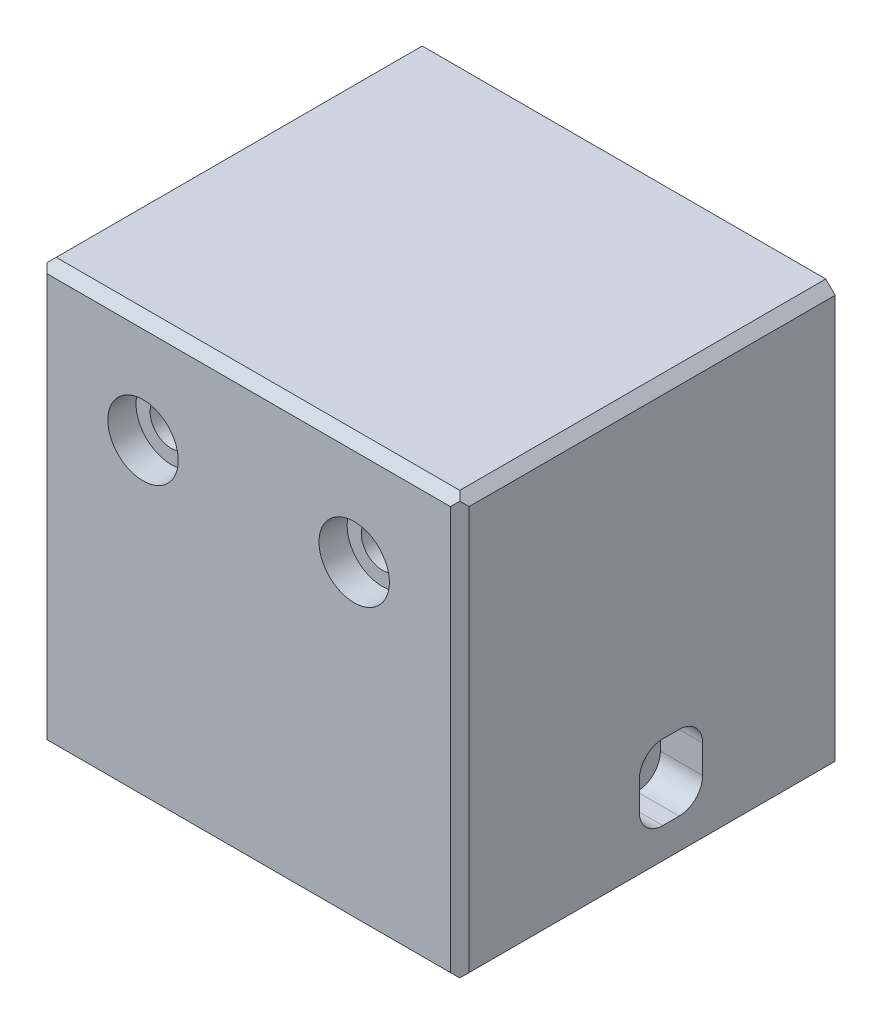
ISO-10303-21;
HEADER;
FILE_DESCRIPTION(('STEP AP214'),'2;1');
FILE_NAME('part.step','',(''),(''),'','','');
FILE_SCHEMA(('AUTOMOTIVE_DESIGN { 1 0 10303 214 1 1 1 1 }'));
ENDSEC;
DATA;
#1=APPLICATION_CONTEXT('core data for automotive mechanical design processes');
#2=APPLICATION_PROTOCOL_DEFINITION('international standard','automotive_design',2000,#1);
#3=PRODUCT_CONTEXT('',#1,'mechanical');
#4=PRODUCT('Part','Part','',(#3));
#5=PRODUCT_RELATED_PRODUCT_CATEGORY('part','',(#4));
#6=PRODUCT_DEFINITION_FORMATION('','',#4);
#7=PRODUCT_DEFINITION_CONTEXT('part definition',#1,'design');
#8=PRODUCT_DEFINITION('design','',#6,#7);
#9=PRODUCT_DEFINITION_SHAPE('','',#8);
#10=(LENGTH_UNIT() NAMED_UNIT(*) SI_UNIT(.MILLI.,.METRE.));
#11=(NAMED_UNIT(*) PLANE_ANGLE_UNIT() SI_UNIT($,.RADIAN.));
#12=(NAMED_UNIT(*) SI_UNIT($,.STERADIAN.) SOLID_ANGLE_UNIT());
#13=UNCERTAINTY_MEASURE_WITH_UNIT(LENGTH_MEASURE(1.E-05),#10,'distance_accuracy_value','');
#14=(GEOMETRIC_REPRESENTATION_CONTEXT(3) GLOBAL_UNCERTAINTY_ASSIGNED_CONTEXT((#13)) GLOBAL_UNIT_ASSIGNED_CONTEXT((#10,
#11,#12)) REPRESENTATION_CONTEXT('',''));
#15=CARTESIAN_POINT('',(0.,0.,0.));
#16=DIRECTION('',(0.,0.,1.));
#17=DIRECTION('',(1.,0.,0.));
#18=AXIS2_PLACEMENT_3D('',#15,#16,#17);
#19=CARTESIAN_POINT('',(-22.4999999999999,-22.5000000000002,74.));
#20=DIRECTION('',(0.,0.,1.));
#21=DIRECTION('',(1.,0.,0.));
#22=AXIS2_PLACEMENT_3D('',#19,#20,#21);
#23=CYLINDRICAL_SURFACE('',#22,7.5);
#24=CARTESIAN_POINT('',(-22.4999999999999,-22.5000000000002,80.));
#25=DIRECTION('',(0.,0.,1.));
#26=DIRECTION('',(1.,0.,0.));
#27=AXIS2_PLACEMENT_3D('',#24,#25,#26);
#28=CIRCLE('',#27,7.5);
#29=CARTESIAN_POINT('',(-14.9999999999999,-22.5000000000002,80.));
#30=VERTEX_POINT('',#29);
#31=EDGE_CURVE('E9',#30,#30,#28,.T.);
#32=ORIENTED_EDGE('',*,*,#31,.T.);
#33=EDGE_LOOP('',(#32));
#34=FACE_BOUND('',#33,.T.);
#35=CARTESIAN_POINT('',(-22.4999999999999,-22.5000000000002,74.));
#36=DIRECTION('',(0.,0.,1.));
#37=DIRECTION('',(1.,0.,0.));
#38=AXIS2_PLACEMENT_3D('',#35,#36,#37);
#39=CIRCLE('',#38,7.5);
#40=CARTESIAN_POINT('',(-14.9999999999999,-22.5000000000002,74.));
#41=VERTEX_POINT('',#40);
#42=EDGE_CURVE('E270',#41,#41,#39,.T.);
#43=ORIENTED_EDGE('',*,*,#42,.F.);
#44=EDGE_LOOP('',(#43));
#45=FACE_BOUND('',#44,.T.);
#46=ADVANCED_FACE('F15',(#34,#45),#23,.F.);
#47=CARTESIAN_POINT('',(-22.4999999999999,-22.5000000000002,15.));
#48=DIRECTION('',(0.,0.,1.));
#49=DIRECTION('',(1.,0.,0.));
#50=AXIS2_PLACEMENT_3D('',#47,#48,#49);
#51=CYLINDRICAL_SURFACE('',#50,4.5);
#52=CARTESIAN_POINT('',(-22.4999999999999,-22.5000000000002,74.));
#53=DIRECTION('',(0.,0.,1.));
#54=DIRECTION('',(1.,0.,0.));
#55=AXIS2_PLACEMENT_3D('',#52,#53,#54);
#56=CIRCLE('',#55,4.5);
#57=CARTESIAN_POINT('',(-17.9999999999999,-22.5000000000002,74.));
#58=VERTEX_POINT('',#57);
#59=EDGE_CURVE('E25',#58,#58,#56,.T.);
#60=ORIENTED_EDGE('',*,*,#59,.T.);
#61=EDGE_LOOP('',(#60));
#62=FACE_BOUND('',#61,.T.);
#63=CARTESIAN_POINT('',(-22.4999999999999,-22.5000000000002,0.));
#64=DIRECTION('',(0.,0.,1.));
#65=DIRECTION('',(1.,0.,0.));
#66=AXIS2_PLACEMENT_3D('',#63,#64,#65);
#67=CIRCLE('',#66,4.5);
#68=CARTESIAN_POINT('',(-17.9999999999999,-22.5000000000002,0.));
#69=VERTEX_POINT('',#68);
#70=EDGE_CURVE('E306',#69,#69,#67,.T.);
#71=ORIENTED_EDGE('',*,*,#70,.F.);
#72=EDGE_LOOP('',(#71));
#73=FACE_BOUND('',#72,.T.);
#74=ADVANCED_FACE('F530',(#62,#73),#51,.F.);
#75=CARTESIAN_POINT('',(22.5000000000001,-22.5000000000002,77.));
#76=DIRECTION('',(0.,0.,-1.));
#77=DIRECTION('',(0.,-1.,0.));
#78=AXIS2_PLACEMENT_3D('',#75,#76,#77);
#79=CYLINDRICAL_SURFACE('',#78,7.5);
#80=CARTESIAN_POINT('',(22.5000000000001,-22.5000000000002,80.));
#81=DIRECTION('',(0.,0.,-1.));
#82=DIRECTION('',(0.,-1.,0.));
#83=AXIS2_PLACEMENT_3D('',#80,#81,#82);
#84=CIRCLE('',#83,7.5);
#85=CARTESIAN_POINT('',(22.5000000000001,-30.0000000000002,80.));
#86=VERTEX_POINT('',#85);
#87=EDGE_CURVE('E275',#86,#86,#84,.T.);
#88=ORIENTED_EDGE('',*,*,#87,.F.);
#89=EDGE_LOOP('',(#88));
#90=FACE_BOUND('',#89,.T.);
#91=CARTESIAN_POINT('',(22.5000000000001,-22.5000000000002,74.));
#92=DIRECTION('',(0.,0.,-1.));
#93=DIRECTION('',(0.,-1.,0.));
#94=AXIS2_PLACEMENT_3D('',#91,#92,#93);
#95=CIRCLE('',#94,7.5);
#96=CARTESIAN_POINT('',(22.5000000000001,-30.0000000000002,74.));
#97=VERTEX_POINT('',#96);
#98=EDGE_CURVE('E511',#97,#97,#95,.T.);
#99=ORIENTED_EDGE('',*,*,#98,.T.);
#100=EDGE_LOOP('',(#99));
#101=FACE_BOUND('',#100,.T.);
#102=ADVANCED_FACE('F537',(#90,#101),#79,.F.);
#103=CARTESIAN_POINT('',(22.5000000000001,-22.5000000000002,37.));
#104=DIRECTION('',(0.,0.,-1.));
#105=DIRECTION('',(0.,-1.,0.));
#106=AXIS2_PLACEMENT_3D('',#103,#104,#105);
#107=CYLINDRICAL_SURFACE('',#106,4.50000000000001);
#108=CARTESIAN_POINT('',(22.5000000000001,-22.5000000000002,74.));
#109=DIRECTION('',(0.,0.,-1.));
#110=DIRECTION('',(0.,-1.,0.));
#111=AXIS2_PLACEMENT_3D('',#108,#109,#110);
#112=CIRCLE('',#111,4.5);
#113=CARTESIAN_POINT('',(22.5000000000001,-27.0000000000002,74.));
#114=VERTEX_POINT('',#113);
#115=EDGE_CURVE('E302',#114,#114,#112,.T.);
#116=ORIENTED_EDGE('',*,*,#115,.F.);
#117=EDGE_LOOP('',(#116));
#118=FACE_BOUND('',#117,.T.);
#119=CARTESIAN_POINT('',(22.5000000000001,-22.5000000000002,0.));
#120=DIRECTION('',(0.,0.,-1.));
#121=DIRECTION('',(0.,-1.,0.));
#122=AXIS2_PLACEMENT_3D('',#119,#120,#121);
#123=CIRCLE('',#122,4.5);
#124=CARTESIAN_POINT('',(22.5000000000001,-27.0000000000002,0.));
#125=VERTEX_POINT('',#124);
#126=EDGE_CURVE('E506',#125,#125,#123,.T.);
#127=ORIENTED_EDGE('',*,*,#126,.T.);
#128=EDGE_LOOP('',(#127));
#129=FACE_BOUND('',#128,.T.);
#130=ADVANCED_FACE('F687',(#118,#129),#107,.F.);
#131=CARTESIAN_POINT('',(-24.2500000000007,-73.5000146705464,35.));
#132=DIRECTION('',(-1.,0.,0.));
#133=DIRECTION('',(0.,0.,1.));
#134=AXIS2_PLACEMENT_3D('',#131,#132,#133);
#135=CYLINDRICAL_SURFACE('',#134,4.50000000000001);
#136=CARTESIAN_POINT('',(-12.5000000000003,-73.5000146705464,35.));
#137=DIRECTION('',(-1.,0.,0.));
#138=DIRECTION('',(0.,0.,1.));
#139=AXIS2_PLACEMENT_3D('',#136,#137,#138);
#140=CIRCLE('',#139,4.5);
#141=CARTESIAN_POINT('',(-12.5000000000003,-73.5000146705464,39.5));
#142=VERTEX_POINT('',#141);
#143=EDGE_CURVE('E342',#142,#142,#140,.T.);
#144=ORIENTED_EDGE('',*,*,#143,.F.);
#145=EDGE_LOOP('',(#144));
#146=FACE_BOUND('',#145,.T.);
#147=CARTESIAN_POINT('',(-36.000000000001,-73.5000146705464,35.));
#148=DIRECTION('',(-1.,0.,0.));
#149=DIRECTION('',(0.,0.,1.));
#150=AXIS2_PLACEMENT_3D('',#147,#148,#149);
#151=CIRCLE('',#150,4.5);
#152=CARTESIAN_POINT('',(-36.000000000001,-73.5000146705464,39.5));
#153=VERTEX_POINT('',#152);
#154=EDGE_CURVE('E503',#153,#153,#151,.T.);
#155=ORIENTED_EDGE('',*,*,#154,.T.);
#156=EDGE_LOOP('',(#155));
#157=FACE_BOUND('',#156,.T.);
#158=ADVANCED_FACE('F690',(#146,#157),#135,.F.);
#159=CARTESIAN_POINT('',(24.2500000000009,-73.5000146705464,35.));
#160=DIRECTION('',(-1.,0.,0.));
#161=DIRECTION('',(0.,1.,0.));
#162=AXIS2_PLACEMENT_3D('',#159,#160,#161);
#163=CYLINDRICAL_SURFACE('',#162,4.50000000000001);
#164=CARTESIAN_POINT('',(36.0000000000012,-73.5000146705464,35.));
#165=DIRECTION('',(1.,0.,0.));
#166=DIRECTION('',(0.,1.,0.));
#167=AXIS2_PLACEMENT_3D('',#164,#165,#166);
#168=CIRCLE('',#167,4.5);
#169=CARTESIAN_POINT('',(36.0000000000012,-69.0000146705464,35.));
#170=VERTEX_POINT('',#169);
#171=EDGE_CURVE('E496',#170,#170,#168,.T.);
#172=ORIENTED_EDGE('',*,*,#171,.T.);
#173=EDGE_LOOP('',(#172));
#174=FACE_BOUND('',#173,.T.);
#175=CARTESIAN_POINT('',(12.5000000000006,-73.5000146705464,35.));
#176=DIRECTION('',(1.,0.,0.));
#177=DIRECTION('',(0.,1.,0.));
#178=AXIS2_PLACEMENT_3D('',#175,#176,#177);
#179=CIRCLE('',#178,4.5);
#180=CARTESIAN_POINT('',(12.5000000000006,-69.0000146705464,35.));
#181=VERTEX_POINT('',#180);
#182=EDGE_CURVE('E498',#181,#181,#179,.T.);
#183=ORIENTED_EDGE('',*,*,#182,.F.);
#184=EDGE_LOOP('',(#183));
#185=FACE_BOUND('',#184,.T.);
#186=ADVANCED_FACE('F696',(#174,#185),#163,.F.);
#187=CARTESIAN_POINT('',(-44.9999999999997,-70.5000146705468,33.25));
#188=DIRECTION('',(1.,0.,0.));
#189=DIRECTION('',(0.,1.,0.));
#190=AXIS2_PLACEMENT_3D('',#187,#188,#189);
#191=CYLINDRICAL_SURFACE('',#190,5.);
#192=CARTESIAN_POINT('',(-36.000000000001,-70.5000146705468,33.25));
#193=DIRECTION('',(-1.,0.,0.));
#194=DIRECTION('',(0.,0.,1.));
#195=AXIS2_PLACEMENT_3D('',#192,#193,#194);
#196=CIRCLE('',#195,5.);
#197=CARTESIAN_POINT('',(-36.0000000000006,-65.5000146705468,33.25));
#198=VERTEX_POINT('',#197);
#199=CARTESIAN_POINT('',(-36.000000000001,-70.5000146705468,28.25));
#200=VERTEX_POINT('',#199);
#201=EDGE_CURVE('E34',#198,#200,#196,.T.);
#202=ORIENTED_EDGE('',*,*,#201,.F.);
#203=DIRECTION('',(1.,0.,0.));
#204=VECTOR('',#203,1.);
#205=CARTESIAN_POINT('',(-44.9999999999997,-65.5000146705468,33.25));
#206=LINE('',#205,#204);
#207=CARTESIAN_POINT('',(-44.9999999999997,-65.5000146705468,33.25));
#208=VERTEX_POINT('',#207);
#209=EDGE_CURVE('E491',#208,#198,#206,.T.);
#210=ORIENTED_EDGE('',*,*,#209,.F.);
#211=CARTESIAN_POINT('',(-44.9999999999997,-70.5000146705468,33.25));
#212=DIRECTION('',(1.,0.,0.));
#213=DIRECTION('',(0.,1.,0.));
#214=AXIS2_PLACEMENT_3D('',#211,#212,#213);
#215=CIRCLE('',#214,5.);
#216=CARTESIAN_POINT('',(-44.9999999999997,-70.5000146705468,28.25));
#217=VERTEX_POINT('',#216);
#218=EDGE_CURVE('E441',#217,#208,#215,.T.);
#219=ORIENTED_EDGE('',*,*,#218,.F.);
#220=DIRECTION('',(-1.,0.,0.));
#221=VECTOR('',#220,1.);
#222=CARTESIAN_POINT('',(-36.000000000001,-70.5000146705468,28.25));
#223=LINE('',#222,#221);
#224=EDGE_CURVE('E458',#200,#217,#223,.T.);
#225=ORIENTED_EDGE('',*,*,#224,.F.);
#226=EDGE_LOOP('',(#202,#210,#219,#225));
#227=FACE_BOUND('',#226,.T.);
#228=ADVANCED_FACE('F542',(#227),#191,.F.);
#229=CARTESIAN_POINT('',(-36.0000000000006,-65.5000146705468,35.));
#230=DIRECTION('',(0.,1.,0.));
#231=DIRECTION('',(0.,0.,1.));
#232=AXIS2_PLACEMENT_3D('',#229,#230,#231);
#233=PLANE('',#232);
#234=ORIENTED_EDGE('',*,*,#209,.T.);
#235=DIRECTION('',(0.,0.,1.));
#236=VECTOR('',#235,1.);
#237=CARTESIAN_POINT('',(-36.0000000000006,-65.5000146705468,33.25));
#238=LINE('',#237,#236);
#239=CARTESIAN_POINT('',(-36.0000000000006,-65.5000146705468,36.75));
#240=VERTEX_POINT('',#239);
#241=EDGE_CURVE('E488',#198,#240,#238,.T.);
#242=ORIENTED_EDGE('',*,*,#241,.T.);
#243=DIRECTION('',(-1.,0.,0.));
#244=VECTOR('',#243,1.);
#245=CARTESIAN_POINT('',(-36.0000000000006,-65.5000146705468,36.75));
#246=LINE('',#245,#244);
#247=CARTESIAN_POINT('',(-44.9999999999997,-65.5000146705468,36.75));
#248=VERTEX_POINT('',#247);
#249=EDGE_CURVE('E482',#240,#248,#246,.T.);
#250=ORIENTED_EDGE('',*,*,#249,.T.);
#251=DIRECTION('',(0.,0.,1.));
#252=VECTOR('',#251,1.);
#253=CARTESIAN_POINT('',(-44.9999999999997,-65.5000146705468,33.25));
#254=LINE('',#253,#252);
#255=EDGE_CURVE('E479',#208,#248,#254,.T.);
#256=ORIENTED_EDGE('',*,*,#255,.F.);
#257=EDGE_LOOP('',(#234,#242,#250,#256));
#258=FACE_BOUND('',#257,.T.);
#259=ADVANCED_FACE('F548',(#258),#233,.F.);
#260=CARTESIAN_POINT('',(-44.9999999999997,-70.5000146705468,36.75));
#261=DIRECTION('',(1.,0.,0.));
#262=DIRECTION('',(0.,1.,0.));
#263=AXIS2_PLACEMENT_3D('',#260,#261,#262);
#264=CYLINDRICAL_SURFACE('',#263,5.);
#265=CARTESIAN_POINT('',(-36.000000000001,-70.5000146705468,36.75));
#266=DIRECTION('',(-1.,0.,0.));
#267=DIRECTION('',(0.,0.,1.));
#268=AXIS2_PLACEMENT_3D('',#265,#266,#267);
#269=CIRCLE('',#268,5.);
#270=CARTESIAN_POINT('',(-36.0000000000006,-70.5000146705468,41.75));
#271=VERTEX_POINT('',#270);
#272=EDGE_CURVE('E475',#271,#240,#269,.T.);
#273=ORIENTED_EDGE('',*,*,#272,.F.);
#274=DIRECTION('',(1.,0.,0.));
#275=VECTOR('',#274,1.);
#276=CARTESIAN_POINT('',(-44.9999999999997,-70.5000146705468,41.75));
#277=LINE('',#276,#275);
#278=CARTESIAN_POINT('',(-44.9999999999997,-70.5000146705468,41.75));
#279=VERTEX_POINT('',#278);
#280=EDGE_CURVE('E472',#279,#271,#277,.T.);
#281=ORIENTED_EDGE('',*,*,#280,.F.);
#282=CARTESIAN_POINT('',(-44.9999999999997,-70.5000146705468,36.75));
#283=DIRECTION('',(1.,0.,0.));
#284=DIRECTION('',(0.,1.,0.));
#285=AXIS2_PLACEMENT_3D('',#282,#283,#284);
#286=CIRCLE('',#285,5.);
#287=EDGE_CURVE('E477',#248,#279,#286,.T.);
#288=ORIENTED_EDGE('',*,*,#287,.F.);
#289=ORIENTED_EDGE('',*,*,#249,.F.);
#290=EDGE_LOOP('',(#273,#281,#288,#289));
#291=FACE_BOUND('',#290,.T.);
#292=ADVANCED_FACE('F544',(#291),#264,.F.);
#293=CARTESIAN_POINT('',(-44.9999999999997,-75.0000146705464,41.75));
#294=DIRECTION('',(0.,0.,1.));
#295=DIRECTION('',(1.,0.,0.));
#296=AXIS2_PLACEMENT_3D('',#293,#294,#295);
#297=PLANE('',#296);
#298=DIRECTION('',(0.,-1.,0.));
#299=VECTOR('',#298,1.);
#300=CARTESIAN_POINT('',(-44.9999999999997,-70.5000146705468,41.75));
#301=LINE('',#300,#299);
#302=CARTESIAN_POINT('',(-44.9999999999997,-76.5000146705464,41.75));
#303=VERTEX_POINT('',#302);
#304=EDGE_CURVE('E449',#279,#303,#301,.T.);
#305=ORIENTED_EDGE('',*,*,#304,.F.);
#306=ORIENTED_EDGE('',*,*,#280,.T.);
#307=DIRECTION('',(0.,1.,0.));
#308=VECTOR('',#307,1.);
#309=CARTESIAN_POINT('',(-36.0000000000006,-76.5000146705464,41.75));
#310=LINE('',#309,#308);
#311=CARTESIAN_POINT('',(-36.0000000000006,-76.5000146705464,41.75));
#312=VERTEX_POINT('',#311);
#313=EDGE_CURVE('E468',#312,#271,#310,.T.);
#314=ORIENTED_EDGE('',*,*,#313,.F.);
#315=DIRECTION('',(-1.,0.,0.));
#316=VECTOR('',#315,1.);
#317=CARTESIAN_POINT('',(-36.0000000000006,-76.5000146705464,41.75));
#318=LINE('',#317,#316);
#319=EDGE_CURVE('E463',#312,#303,#318,.T.);
#320=ORIENTED_EDGE('',*,*,#319,.T.);
#321=EDGE_LOOP('',(#305,#306,#314,#320));
#322=FACE_BOUND('',#321,.T.);
#323=ADVANCED_FACE('F547',(#322),#297,.F.);
#324=CARTESIAN_POINT('',(-44.9999999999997,-76.5000146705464,33.25));
#325=DIRECTION('',(1.,0.,0.));
#326=DIRECTION('',(0.,1.,0.));
#327=AXIS2_PLACEMENT_3D('',#324,#325,#326);
#328=CYLINDRICAL_SURFACE('',#327,5.);
#329=CARTESIAN_POINT('',(-36.000000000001,-76.5000146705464,33.25));
#330=DIRECTION('',(-1.,0.,0.));
#331=DIRECTION('',(0.,0.,1.));
#332=AXIS2_PLACEMENT_3D('',#329,#330,#331);
#333=CIRCLE('',#332,5.);
#334=CARTESIAN_POINT('',(-36.000000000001,-76.5000146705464,28.25));
#335=VERTEX_POINT('',#334);
#336=CARTESIAN_POINT('',(-36.0000000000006,-81.5000146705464,33.25));
#337=VERTEX_POINT('',#336);
#338=EDGE_CURVE('E445',#335,#337,#333,.T.);
#339=ORIENTED_EDGE('',*,*,#338,.F.);
#340=DIRECTION('',(1.,0.,0.));
#341=VECTOR('',#340,1.);
#342=CARTESIAN_POINT('',(-44.9999999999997,-76.5000146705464,28.25));
#343=LINE('',#342,#341);
#344=CARTESIAN_POINT('',(-44.9999999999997,-76.5000146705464,28.25));
#345=VERTEX_POINT('',#344);
#346=EDGE_CURVE('E465',#345,#335,#343,.T.);
#347=ORIENTED_EDGE('',*,*,#346,.F.);
#348=CARTESIAN_POINT('',(-44.9999999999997,-76.5000146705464,33.25));
#349=DIRECTION('',(1.,0.,0.));
#350=DIRECTION('',(0.,1.,0.));
#351=AXIS2_PLACEMENT_3D('',#348,#349,#350);
#352=CIRCLE('',#351,5.);
#353=CARTESIAN_POINT('',(-44.9999999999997,-81.5000146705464,33.25));
#354=VERTEX_POINT('',#353);
#355=EDGE_CURVE('E361',#354,#345,#352,.T.);
#356=ORIENTED_EDGE('',*,*,#355,.F.);
#357=DIRECTION('',(-1.,0.,0.));
#358=VECTOR('',#357,1.);
#359=CARTESIAN_POINT('',(-36.0000000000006,-81.5000146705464,33.25));
#360=LINE('',#359,#358);
#361=EDGE_CURVE('E457',#337,#354,#360,.T.);
#362=ORIENTED_EDGE('',*,*,#361,.F.);
#363=EDGE_LOOP('',(#339,#347,#356,#362));
#364=FACE_BOUND('',#363,.T.);
#365=ADVANCED_FACE('F550',(#364),#328,.F.);
#366=CARTESIAN_POINT('',(-44.9999999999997,-81.5000146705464,28.25));
#367=DIRECTION('',(0.,-1.,0.));
#368=DIRECTION('',(0.,0.,-1.));
#369=AXIS2_PLACEMENT_3D('',#366,#367,#368);
#370=PLANE('',#369);
#371=ORIENTED_EDGE('',*,*,#361,.T.);
#372=DIRECTION('',(0.,0.,-1.));
#373=VECTOR('',#372,1.);
#374=CARTESIAN_POINT('',(-44.9999999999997,-81.5000146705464,36.75));
#375=LINE('',#374,#373);
#376=CARTESIAN_POINT('',(-44.9999999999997,-81.5000146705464,36.75));
#377=VERTEX_POINT('',#376);
#378=EDGE_CURVE('E355',#377,#354,#375,.T.);
#379=ORIENTED_EDGE('',*,*,#378,.F.);
#380=DIRECTION('',(1.,0.,0.));
#381=VECTOR('',#380,1.);
#382=CARTESIAN_POINT('',(-44.9999999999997,-81.5000146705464,36.75));
#383=LINE('',#382,#381);
#384=CARTESIAN_POINT('',(-36.0000000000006,-81.5000146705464,36.75));
#385=VERTEX_POINT('',#384);
#386=EDGE_CURVE('E454',#377,#385,#383,.T.);
#387=ORIENTED_EDGE('',*,*,#386,.T.);
#388=DIRECTION('',(0.,0.,1.));
#389=VECTOR('',#388,1.);
#390=CARTESIAN_POINT('',(-36.0000000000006,-81.5000146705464,33.25));
#391=LINE('',#390,#389);
#392=EDGE_CURVE('E452',#337,#385,#391,.T.);
#393=ORIENTED_EDGE('',*,*,#392,.F.);
#394=EDGE_LOOP('',(#371,#379,#387,#393));
#395=FACE_BOUND('',#394,.T.);
#396=ADVANCED_FACE('F553',(#395),#370,.F.);
#397=CARTESIAN_POINT('',(-44.9999999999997,-76.5000146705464,36.75));
#398=DIRECTION('',(1.,0.,0.));
#399=DIRECTION('',(0.,1.,0.));
#400=AXIS2_PLACEMENT_3D('',#397,#398,#399);
#401=CYLINDRICAL_SURFACE('',#400,5.);
#402=CARTESIAN_POINT('',(-36.000000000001,-76.5000146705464,36.75));
#403=DIRECTION('',(-1.,0.,0.));
#404=DIRECTION('',(0.,0.,1.));
#405=AXIS2_PLACEMENT_3D('',#402,#403,#404);
#406=CIRCLE('',#405,5.);
#407=EDGE_CURVE('E437',#385,#312,#406,.T.);
#408=ORIENTED_EDGE('',*,*,#407,.F.);
#409=ORIENTED_EDGE('',*,*,#386,.F.);
#410=CARTESIAN_POINT('',(-44.9999999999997,-76.5000146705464,36.75));
#411=DIRECTION('',(1.,0.,0.));
#412=DIRECTION('',(0.,1.,0.));
#413=AXIS2_PLACEMENT_3D('',#410,#411,#412);
#414=CIRCLE('',#413,5.);
#415=EDGE_CURVE('E446',#303,#377,#414,.T.);
#416=ORIENTED_EDGE('',*,*,#415,.F.);
#417=ORIENTED_EDGE('',*,*,#319,.F.);
#418=EDGE_LOOP('',(#408,#409,#416,#417));
#419=FACE_BOUND('',#418,.T.);
#420=ADVANCED_FACE('F555',(#419),#401,.F.);
#421=CARTESIAN_POINT('',(-44.9999999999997,-72.0000146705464,28.25));
#422=DIRECTION('',(0.,0.,-1.));
#423=DIRECTION('',(-1.,0.,0.));
#424=AXIS2_PLACEMENT_3D('',#421,#422,#423);
#425=PLANE('',#424);
#426=DIRECTION('',(0.,-1.,0.));
#427=VECTOR('',#426,1.);
#428=CARTESIAN_POINT('',(-36.000000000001,-76.5000146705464,28.25));
#429=LINE('',#428,#427);
#430=EDGE_CURVE('E442',#200,#335,#429,.T.);
#431=ORIENTED_EDGE('',*,*,#430,.F.);
#432=ORIENTED_EDGE('',*,*,#224,.T.);
#433=DIRECTION('',(0.,1.,0.));
#434=VECTOR('',#433,1.);
#435=CARTESIAN_POINT('',(-44.9999999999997,-76.5000146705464,28.25));
#436=LINE('',#435,#434);
#437=EDGE_CURVE('E438',#345,#217,#436,.T.);
#438=ORIENTED_EDGE('',*,*,#437,.F.);
#439=ORIENTED_EDGE('',*,*,#346,.T.);
#440=EDGE_LOOP('',(#431,#432,#438,#439));
#441=FACE_BOUND('',#440,.T.);
#442=ADVANCED_FACE('F558',(#441),#425,.F.);
#443=CARTESIAN_POINT('',(-36.000000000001,-79.5000146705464,34.75));
#444=DIRECTION('',(1.,0.,0.));
#445=DIRECTION('',(0.,0.,-1.));
#446=AXIS2_PLACEMENT_3D('',#443,#444,#445);
#447=PLANE('',#446);
#448=ORIENTED_EDGE('',*,*,#313,.T.);
#449=ORIENTED_EDGE('',*,*,#272,.T.);
#450=ORIENTED_EDGE('',*,*,#241,.F.);
#451=ORIENTED_EDGE('',*,*,#201,.T.);
#452=ORIENTED_EDGE('',*,*,#430,.T.);
#453=ORIENTED_EDGE('',*,*,#338,.T.);
#454=ORIENTED_EDGE('',*,*,#392,.T.);
#455=ORIENTED_EDGE('',*,*,#407,.T.);
#456=EDGE_LOOP('',(#448,#449,#450,#451,#452,#453,#454,#455));
#457=FACE_BOUND('',#456,.T.);
#458=ORIENTED_EDGE('',*,*,#154,.F.);
#459=EDGE_LOOP('',(#458));
#460=FACE_BOUND('',#459,.T.);
#461=ADVANCED_FACE('F564',(#457,#460),#447,.F.);
#462=CARTESIAN_POINT('',(40.5000000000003,-70.5000146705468,33.25));
#463=DIRECTION('',(1.,0.,0.));
#464=DIRECTION('',(0.,1.,0.));
#465=AXIS2_PLACEMENT_3D('',#462,#463,#464);
#466=CYLINDRICAL_SURFACE('',#465,4.99999999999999);
#467=CARTESIAN_POINT('',(36.0000000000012,-70.5000146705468,33.25));
#468=DIRECTION('',(-1.,0.,0.));
#469=DIRECTION('',(0.,0.,1.));
#470=AXIS2_PLACEMENT_3D('',#467,#468,#469);
#471=CIRCLE('',#470,5.);
#472=CARTESIAN_POINT('',(36.0000000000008,-65.5000146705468,33.25));
#473=VERTEX_POINT('',#472);
#474=CARTESIAN_POINT('',(36.0000000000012,-70.5000146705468,28.25));
#475=VERTEX_POINT('',#474);
#476=EDGE_CURVE('E434',#473,#475,#471,.T.);
#477=ORIENTED_EDGE('',*,*,#476,.T.);
#478=DIRECTION('',(1.,0.,0.));
#479=VECTOR('',#478,1.);
#480=CARTESIAN_POINT('',(36.0000000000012,-70.5000146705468,28.25));
#481=LINE('',#480,#479);
#482=CARTESIAN_POINT('',(44.9999999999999,-70.5000146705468,28.25));
#483=VERTEX_POINT('',#482);
#484=EDGE_CURVE('E430',#475,#483,#481,.T.);
#485=ORIENTED_EDGE('',*,*,#484,.T.);
#486=CARTESIAN_POINT('',(44.9999999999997,-70.5000146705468,33.25));
#487=DIRECTION('',(-1.,0.,0.));
#488=DIRECTION('',(0.,0.,1.));
#489=AXIS2_PLACEMENT_3D('',#486,#487,#488);
#490=CIRCLE('',#489,5.);
#491=CARTESIAN_POINT('',(44.9999999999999,-65.5000146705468,33.25));
#492=VERTEX_POINT('',#491);
#493=EDGE_CURVE('E378',#492,#483,#490,.T.);
#494=ORIENTED_EDGE('',*,*,#493,.F.);
#495=DIRECTION('',(-1.,0.,0.));
#496=VECTOR('',#495,1.);
#497=CARTESIAN_POINT('',(44.9999999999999,-65.5000146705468,33.25));
#498=LINE('',#497,#496);
#499=EDGE_CURVE('E423',#492,#473,#498,.T.);
#500=ORIENTED_EDGE('',*,*,#499,.T.);
#501=EDGE_LOOP('',(#477,#485,#494,#500));
#502=FACE_BOUND('',#501,.T.);
#503=ADVANCED_FACE('F560',(#502),#466,.F.);
#504=CARTESIAN_POINT('',(44.9999999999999,-65.5000146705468,28.25));
#505=DIRECTION('',(0.,1.,0.));
#506=DIRECTION('',(0.,0.,1.));
#507=AXIS2_PLACEMENT_3D('',#504,#505,#506);
#508=PLANE('',#507);
#509=ORIENTED_EDGE('',*,*,#499,.F.);
#510=DIRECTION('',(0.,0.,-1.));
#511=VECTOR('',#510,1.);
#512=CARTESIAN_POINT('',(44.9999999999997,-65.5000146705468,36.75));
#513=LINE('',#512,#511);
#514=CARTESIAN_POINT('',(44.9999999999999,-65.5000146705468,36.75));
#515=VERTEX_POINT('',#514);
#516=EDGE_CURVE('E419',#515,#492,#513,.T.);
#517=ORIENTED_EDGE('',*,*,#516,.F.);
#518=DIRECTION('',(1.,0.,0.));
#519=VECTOR('',#518,1.);
#520=CARTESIAN_POINT('',(36.0000000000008,-65.5000146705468,36.75));
#521=LINE('',#520,#519);
#522=CARTESIAN_POINT('',(36.0000000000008,-65.5000146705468,36.75));
#523=VERTEX_POINT('',#522);
#524=EDGE_CURVE('E416',#523,#515,#521,.T.);
#525=ORIENTED_EDGE('',*,*,#524,.F.);
#526=DIRECTION('',(0.,0.,1.));
#527=VECTOR('',#526,1.);
#528=CARTESIAN_POINT('',(36.0000000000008,-65.5000146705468,33.25));
#529=LINE('',#528,#527);
#530=EDGE_CURVE('E374',#473,#523,#529,.T.);
#531=ORIENTED_EDGE('',*,*,#530,.F.);
#532=EDGE_LOOP('',(#509,#517,#525,#531));
#533=FACE_BOUND('',#532,.T.);
#534=ADVANCED_FACE('F563',(#533),#508,.F.);
#535=CARTESIAN_POINT('',(40.5000000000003,-70.5000146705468,36.75));
#536=DIRECTION('',(1.,0.,0.));
#537=DIRECTION('',(0.,1.,0.));
#538=AXIS2_PLACEMENT_3D('',#535,#536,#537);
#539=CYLINDRICAL_SURFACE('',#538,5.);
#540=CARTESIAN_POINT('',(36.0000000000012,-70.5000146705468,36.75));
#541=DIRECTION('',(-1.,0.,0.));
#542=DIRECTION('',(0.,0.,1.));
#543=AXIS2_PLACEMENT_3D('',#540,#541,#542);
#544=CIRCLE('',#543,5.);
#545=CARTESIAN_POINT('',(36.0000000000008,-70.5000146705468,41.75));
#546=VERTEX_POINT('',#545);
#547=EDGE_CURVE('E420',#546,#523,#544,.T.);
#548=ORIENTED_EDGE('',*,*,#547,.T.);
#549=ORIENTED_EDGE('',*,*,#524,.T.);
#550=CARTESIAN_POINT('',(44.9999999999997,-70.5000146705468,36.75));
#551=DIRECTION('',(-1.,0.,0.));
#552=DIRECTION('',(0.,0.,1.));
#553=AXIS2_PLACEMENT_3D('',#550,#551,#552);
#554=CIRCLE('',#553,5.);
#555=CARTESIAN_POINT('',(44.9999999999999,-70.5000146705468,41.75));
#556=VERTEX_POINT('',#555);
#557=EDGE_CURVE('E414',#556,#515,#554,.T.);
#558=ORIENTED_EDGE('',*,*,#557,.F.);
#559=DIRECTION('',(-1.,0.,0.));
#560=VECTOR('',#559,1.);
#561=CARTESIAN_POINT('',(44.9999999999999,-70.5000146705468,41.75));
#562=LINE('',#561,#560);
#563=EDGE_CURVE('E409',#556,#546,#562,.T.);
#564=ORIENTED_EDGE('',*,*,#563,.T.);
#565=EDGE_LOOP('',(#548,#549,#558,#564));
#566=FACE_BOUND('',#565,.T.);
#567=ADVANCED_FACE('F572',(#566),#539,.F.);
#568=CARTESIAN_POINT('',(40.5000000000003,-70.5000146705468,41.75));
#569=DIRECTION('',(0.,0.,1.));
#570=DIRECTION('',(1.,0.,0.));
#571=AXIS2_PLACEMENT_3D('',#568,#569,#570);
#572=PLANE('',#571);
#573=DIRECTION('',(0.,1.,0.));
#574=VECTOR('',#573,1.);
#575=CARTESIAN_POINT('',(44.9999999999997,-76.5000146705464,41.75));
#576=LINE('',#575,#574);
#577=CARTESIAN_POINT('',(44.9999999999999,-76.5000146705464,41.75));
#578=VERTEX_POINT('',#577);
#579=EDGE_CURVE('E387',#578,#556,#576,.T.);
#580=ORIENTED_EDGE('',*,*,#579,.F.);
#581=DIRECTION('',(1.,0.,0.));
#582=VECTOR('',#581,1.);
#583=CARTESIAN_POINT('',(36.0000000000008,-76.5000146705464,41.75));
#584=LINE('',#583,#582);
#585=CARTESIAN_POINT('',(36.0000000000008,-76.5000146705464,41.75));
#586=VERTEX_POINT('',#585);
#587=EDGE_CURVE('E392',#586,#578,#584,.T.);
#588=ORIENTED_EDGE('',*,*,#587,.F.);
#589=DIRECTION('',(0.,1.,0.));
#590=VECTOR('',#589,1.);
#591=CARTESIAN_POINT('',(36.0000000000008,-76.5000146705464,41.75));
#592=LINE('',#591,#590);
#593=EDGE_CURVE('E406',#586,#546,#592,.T.);
#594=ORIENTED_EDGE('',*,*,#593,.T.);
#595=ORIENTED_EDGE('',*,*,#563,.F.);
#596=EDGE_LOOP('',(#580,#588,#594,#595));
#597=FACE_BOUND('',#596,.T.);
#598=ADVANCED_FACE('F570',(#597),#572,.F.);
#599=CARTESIAN_POINT('',(40.5000000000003,-76.5000146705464,33.25));
#600=DIRECTION('',(1.,0.,0.));
#601=DIRECTION('',(0.,1.,0.));
#602=AXIS2_PLACEMENT_3D('',#599,#600,#601);
#603=CYLINDRICAL_SURFACE('',#602,4.99999999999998);
#604=CARTESIAN_POINT('',(36.0000000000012,-76.5000146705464,33.25));
#605=DIRECTION('',(-1.,0.,0.));
#606=DIRECTION('',(0.,0.,1.));
#607=AXIS2_PLACEMENT_3D('',#604,#605,#606);
#608=CIRCLE('',#607,5.);
#609=CARTESIAN_POINT('',(36.0000000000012,-76.5000146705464,28.25));
#610=VERTEX_POINT('',#609);
#611=CARTESIAN_POINT('',(36.0000000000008,-81.5000146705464,33.25));
#612=VERTEX_POINT('',#611);
#613=EDGE_CURVE('E403',#610,#612,#608,.T.);
#614=ORIENTED_EDGE('',*,*,#613,.T.);
#615=DIRECTION('',(1.,0.,0.));
#616=VECTOR('',#615,1.);
#617=CARTESIAN_POINT('',(36.0000000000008,-81.5000146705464,33.25));
#618=LINE('',#617,#616);
#619=CARTESIAN_POINT('',(44.9999999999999,-81.5000146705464,33.25));
#620=VERTEX_POINT('',#619);
#621=EDGE_CURVE('E399',#612,#620,#618,.T.);
#622=ORIENTED_EDGE('',*,*,#621,.T.);
#623=CARTESIAN_POINT('',(44.9999999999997,-76.5000146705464,33.25));
#624=DIRECTION('',(-1.,0.,0.));
#625=DIRECTION('',(0.,0.,1.));
#626=AXIS2_PLACEMENT_3D('',#623,#624,#625);
#627=CIRCLE('',#626,5.);
#628=CARTESIAN_POINT('',(44.9999999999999,-76.5000146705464,28.25));
#629=VERTEX_POINT('',#628);
#630=EDGE_CURVE('E370',#629,#620,#627,.T.);
#631=ORIENTED_EDGE('',*,*,#630,.F.);
#632=DIRECTION('',(-1.,0.,0.));
#633=VECTOR('',#632,1.);
#634=CARTESIAN_POINT('',(44.9999999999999,-76.5000146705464,28.25));
#635=LINE('',#634,#633);
#636=EDGE_CURVE('E397',#629,#610,#635,.T.);
#637=ORIENTED_EDGE('',*,*,#636,.T.);
#638=EDGE_LOOP('',(#614,#622,#631,#637));
#639=FACE_BOUND('',#638,.T.);
#640=ADVANCED_FACE('F566',(#639),#603,.F.);
#641=CARTESIAN_POINT('',(36.0000000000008,-81.5000146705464,35.));
#642=DIRECTION('',(0.,-1.,0.));
#643=DIRECTION('',(0.,0.,-1.));
#644=AXIS2_PLACEMENT_3D('',#641,#642,#643);
#645=PLANE('',#644);
#646=ORIENTED_EDGE('',*,*,#621,.F.);
#647=DIRECTION('',(0.,0.,1.));
#648=VECTOR('',#647,1.);
#649=CARTESIAN_POINT('',(36.0000000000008,-81.5000146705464,33.25));
#650=LINE('',#649,#648);
#651=CARTESIAN_POINT('',(36.0000000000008,-81.5000146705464,36.75));
#652=VERTEX_POINT('',#651);
#653=EDGE_CURVE('E391',#612,#652,#650,.T.);
#654=ORIENTED_EDGE('',*,*,#653,.T.);
#655=DIRECTION('',(-1.,0.,0.));
#656=VECTOR('',#655,1.);
#657=CARTESIAN_POINT('',(44.9999999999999,-81.5000146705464,36.75));
#658=LINE('',#657,#656);
#659=CARTESIAN_POINT('',(44.9999999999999,-81.5000146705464,36.75));
#660=VERTEX_POINT('',#659);
#661=EDGE_CURVE('E382',#660,#652,#658,.T.);
#662=ORIENTED_EDGE('',*,*,#661,.F.);
#663=DIRECTION('',(0.,0.,1.));
#664=VECTOR('',#663,1.);
#665=CARTESIAN_POINT('',(44.9999999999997,-81.5000146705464,33.25));
#666=LINE('',#665,#664);
#667=EDGE_CURVE('E386',#620,#660,#666,.T.);
#668=ORIENTED_EDGE('',*,*,#667,.F.);
#669=EDGE_LOOP('',(#646,#654,#662,#668));
#670=FACE_BOUND('',#669,.T.);
#671=ADVANCED_FACE('F569',(#670),#645,.F.);
#672=CARTESIAN_POINT('',(40.5000000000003,-76.5000146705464,36.75));
#673=DIRECTION('',(1.,0.,0.));
#674=DIRECTION('',(0.,1.,0.));
#675=AXIS2_PLACEMENT_3D('',#672,#673,#674);
#676=CYLINDRICAL_SURFACE('',#675,5.00000000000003);
#677=CARTESIAN_POINT('',(36.0000000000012,-76.5000146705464,36.75));
#678=DIRECTION('',(-1.,0.,0.));
#679=DIRECTION('',(0.,0.,1.));
#680=AXIS2_PLACEMENT_3D('',#677,#678,#679);
#681=CIRCLE('',#680,5.);
#682=EDGE_CURVE('E388',#652,#586,#681,.T.);
#683=ORIENTED_EDGE('',*,*,#682,.T.);
#684=ORIENTED_EDGE('',*,*,#587,.T.);
#685=CARTESIAN_POINT('',(44.9999999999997,-76.5000146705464,36.75));
#686=DIRECTION('',(-1.,0.,0.));
#687=DIRECTION('',(0.,0.,1.));
#688=AXIS2_PLACEMENT_3D('',#685,#686,#687);
#689=CIRCLE('',#688,5.);
#690=EDGE_CURVE('E383',#660,#578,#689,.T.);
#691=ORIENTED_EDGE('',*,*,#690,.F.);
#692=ORIENTED_EDGE('',*,*,#661,.T.);
#693=EDGE_LOOP('',(#683,#684,#691,#692));
#694=FACE_BOUND('',#693,.T.);
#695=ADVANCED_FACE('F575',(#694),#676,.F.);
#696=CARTESIAN_POINT('',(40.5000000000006,-70.5000146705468,28.25));
#697=DIRECTION('',(0.,0.,-1.));
#698=DIRECTION('',(-1.,0.,0.));
#699=AXIS2_PLACEMENT_3D('',#696,#697,#698);
#700=PLANE('',#699);
#701=DIRECTION('',(0.,-1.,0.));
#702=VECTOR('',#701,1.);
#703=CARTESIAN_POINT('',(36.0000000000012,-76.5000146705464,28.25));
#704=LINE('',#703,#702);
#705=EDGE_CURVE('E379',#475,#610,#704,.T.);
#706=ORIENTED_EDGE('',*,*,#705,.T.);
#707=ORIENTED_EDGE('',*,*,#636,.F.);
#708=DIRECTION('',(0.,-1.,0.));
#709=VECTOR('',#708,1.);
#710=CARTESIAN_POINT('',(44.9999999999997,-70.5000146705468,28.25));
#711=LINE('',#710,#709);
#712=EDGE_CURVE('E365',#483,#629,#711,.T.);
#713=ORIENTED_EDGE('',*,*,#712,.F.);
#714=ORIENTED_EDGE('',*,*,#484,.F.);
#715=EDGE_LOOP('',(#706,#707,#713,#714));
#716=FACE_BOUND('',#715,.T.);
#717=ADVANCED_FACE('F577',(#716),#700,.F.);
#718=CARTESIAN_POINT('',(36.0000000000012,-65.5000146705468,35.));
#719=DIRECTION('',(-1.,0.,0.));
#720=DIRECTION('',(0.,0.,1.));
#721=AXIS2_PLACEMENT_3D('',#718,#719,#720);
#722=PLANE('',#721);
#723=ORIENTED_EDGE('',*,*,#593,.F.);
#724=ORIENTED_EDGE('',*,*,#682,.F.);
#725=ORIENTED_EDGE('',*,*,#653,.F.);
#726=ORIENTED_EDGE('',*,*,#613,.F.);
#727=ORIENTED_EDGE('',*,*,#705,.F.);
#728=ORIENTED_EDGE('',*,*,#476,.F.);
#729=ORIENTED_EDGE('',*,*,#530,.T.);
#730=ORIENTED_EDGE('',*,*,#547,.F.);
#731=EDGE_LOOP('',(#723,#724,#725,#726,#727,#728,#729,#730));
#732=FACE_BOUND('',#731,.T.);
#733=ORIENTED_EDGE('',*,*,#171,.F.);
#734=EDGE_LOOP('',(#733));
#735=FACE_BOUND('',#734,.T.);
#736=ADVANCED_FACE('F583',(#732,#735),#722,.F.);
#737=CARTESIAN_POINT('',(44.9999999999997,-88.,39.));
#738=DIRECTION('',(1.,0.,0.));
#739=DIRECTION('',(0.,1.,0.));
#740=AXIS2_PLACEMENT_3D('',#737,#738,#739);
#741=PLANE('',#740);
#742=DIRECTION('',(0.,0.,1.));
#743=VECTOR('',#742,1.);
#744=CARTESIAN_POINT('',(44.9999999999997,-88.,0.));
#745=LINE('',#744,#743);
#746=CARTESIAN_POINT('',(44.9999999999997,-88.,0.));
#747=VERTEX_POINT('',#746);
#748=CARTESIAN_POINT('',(44.9999999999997,-88.,78.));
#749=VERTEX_POINT('',#748);
#750=EDGE_CURVE('E287',#747,#749,#745,.T.);
#751=ORIENTED_EDGE('',*,*,#750,.F.);
#752=DIRECTION('',(0.,1.,0.));
#753=VECTOR('',#752,1.);
#754=CARTESIAN_POINT('',(44.9999999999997,-88.,0.));
#755=LINE('',#754,#753);
#756=CARTESIAN_POINT('',(44.9999999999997,-2.,0.));
#757=VERTEX_POINT('',#756);
#758=EDGE_CURVE('E369',#747,#757,#755,.T.);
#759=ORIENTED_EDGE('',*,*,#758,.T.);
#760=DIRECTION('',(0.,0.,-1.));
#761=VECTOR('',#760,1.);
#762=CARTESIAN_POINT('',(44.9999999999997,-2.,0.));
#763=LINE('',#762,#761);
#764=CARTESIAN_POINT('',(44.9999999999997,-2.,78.));
#765=VERTEX_POINT('',#764);
#766=EDGE_CURVE('E288',#765,#757,#763,.T.);
#767=ORIENTED_EDGE('',*,*,#766,.F.);
#768=DIRECTION('',(0.,-1.,0.));
#769=VECTOR('',#768,1.);
#770=CARTESIAN_POINT('',(44.9999999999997,-2.,78.));
#771=LINE('',#770,#769);
#772=EDGE_CURVE('E366',#765,#749,#771,.T.);
#773=ORIENTED_EDGE('',*,*,#772,.T.);
#774=EDGE_LOOP('',(#751,#759,#767,#773));
#775=FACE_BOUND('',#774,.T.);
#776=ORIENTED_EDGE('',*,*,#630,.T.);
#777=ORIENTED_EDGE('',*,*,#667,.T.);
#778=ORIENTED_EDGE('',*,*,#690,.T.);
#779=ORIENTED_EDGE('',*,*,#579,.T.);
#780=ORIENTED_EDGE('',*,*,#557,.T.);
#781=ORIENTED_EDGE('',*,*,#516,.T.);
#782=ORIENTED_EDGE('',*,*,#493,.T.);
#783=ORIENTED_EDGE('',*,*,#712,.T.);
#784=EDGE_LOOP('',(#776,#777,#778,#779,#780,#781,#782,#783));
#785=FACE_BOUND('',#784,.T.);
#786=ADVANCED_FACE('F600',(#775,#785),#741,.T.);
#787=CARTESIAN_POINT('',(-44.9999999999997,-87.0000293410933,20.));
#788=DIRECTION('',(-1.,0.,0.));
#789=DIRECTION('',(0.,0.,1.));
#790=AXIS2_PLACEMENT_3D('',#787,#788,#789);
#791=PLANE('',#790);
#792=DIRECTION('',(0.,0.,1.));
#793=VECTOR('',#792,1.);
#794=CARTESIAN_POINT('',(-44.9999999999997,-88.,0.));
#795=LINE('',#794,#793);
#796=CARTESIAN_POINT('',(-44.9999999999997,-88.,0.));
#797=VERTEX_POINT('',#796);
#798=CARTESIAN_POINT('',(-44.9999999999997,-88.,78.));
#799=VERTEX_POINT('',#798);
#800=EDGE_CURVE('E360',#797,#799,#795,.T.);
#801=ORIENTED_EDGE('',*,*,#800,.T.);
#802=DIRECTION('',(0.,-1.,0.));
#803=VECTOR('',#802,1.);
#804=CARTESIAN_POINT('',(-44.9999999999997,-2.,78.));
#805=LINE('',#804,#803);
#806=CARTESIAN_POINT('',(-44.9999999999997,-2.,78.));
#807=VERTEX_POINT('',#806);
#808=EDGE_CURVE('E263',#807,#799,#805,.T.);
#809=ORIENTED_EDGE('',*,*,#808,.F.);
#810=DIRECTION('',(0.,0.,-1.));
#811=VECTOR('',#810,1.);
#812=CARTESIAN_POINT('',(-44.9999999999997,-2.,0.));
#813=LINE('',#812,#811);
#814=CARTESIAN_POINT('',(-44.9999999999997,-2.,0.));
#815=VERTEX_POINT('',#814);
#816=EDGE_CURVE('E357',#807,#815,#813,.T.);
#817=ORIENTED_EDGE('',*,*,#816,.T.);
#818=DIRECTION('',(0.,1.,0.));
#819=VECTOR('',#818,1.);
#820=CARTESIAN_POINT('',(-44.9999999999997,-88.,0.));
#821=LINE('',#820,#819);
#822=EDGE_CURVE('E305',#797,#815,#821,.T.);
#823=ORIENTED_EDGE('',*,*,#822,.F.);
#824=EDGE_LOOP('',(#801,#809,#817,#823));
#825=FACE_BOUND('',#824,.T.);
#826=ORIENTED_EDGE('',*,*,#355,.T.);
#827=ORIENTED_EDGE('',*,*,#437,.T.);
#828=ORIENTED_EDGE('',*,*,#218,.T.);
#829=ORIENTED_EDGE('',*,*,#255,.T.);
#830=ORIENTED_EDGE('',*,*,#287,.T.);
#831=ORIENTED_EDGE('',*,*,#304,.T.);
#832=ORIENTED_EDGE('',*,*,#415,.T.);
#833=ORIENTED_EDGE('',*,*,#378,.T.);
#834=EDGE_LOOP('',(#826,#827,#828,#829,#830,#831,#832,#833));
#835=FACE_BOUND('',#834,.T.);
#836=ADVANCED_FACE('F623',(#825,#835),#791,.T.);
#837=CARTESIAN_POINT('',(-12.5000000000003,-45.,36.));
#838=DIRECTION('',(1.,0.,0.));
#839=DIRECTION('',(0.,1.,0.));
#840=AXIS2_PLACEMENT_3D('',#837,#838,#839);
#841=PLANE('',#840);
#842=DIRECTION('',(0.,1.,0.));
#843=VECTOR('',#842,1.);
#844=CARTESIAN_POINT('',(-12.5000000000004,-45.,0.));
#845=LINE('',#844,#843);
#846=CARTESIAN_POINT('',(-12.5000000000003,-90.,0.));
#847=VERTEX_POINT('',#846);
#848=CARTESIAN_POINT('',(-12.4999999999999,-45.,0.));
#849=VERTEX_POINT('',#848);
#850=EDGE_CURVE('E352',#847,#849,#845,.T.);
#851=ORIENTED_EDGE('',*,*,#850,.T.);
#852=DIRECTION('',(0.,0.,1.));
#853=VECTOR('',#852,1.);
#854=CARTESIAN_POINT('',(-12.4999999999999,-45.,0.));
#855=LINE('',#854,#853);
#856=CARTESIAN_POINT('',(-12.4999999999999,-45.,72.));
#857=VERTEX_POINT('',#856);
#858=EDGE_CURVE('E348',#849,#857,#855,.T.);
#859=ORIENTED_EDGE('',*,*,#858,.T.);
#860=DIRECTION('',(0.,1.,0.));
#861=VECTOR('',#860,1.);
#862=CARTESIAN_POINT('',(-12.4999999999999,-90.,72.));
#863=LINE('',#862,#861);
#864=CARTESIAN_POINT('',(-12.5000000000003,-90.,72.));
#865=VERTEX_POINT('',#864);
#866=EDGE_CURVE('E345',#865,#857,#863,.T.);
#867=ORIENTED_EDGE('',*,*,#866,.F.);
#868=DIRECTION('',(0.,0.,-1.));
#869=VECTOR('',#868,1.);
#870=CARTESIAN_POINT('',(-12.5000000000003,-90.,72.));
#871=LINE('',#870,#869);
#872=EDGE_CURVE('E346',#865,#847,#871,.T.);
#873=ORIENTED_EDGE('',*,*,#872,.T.);
#874=EDGE_LOOP('',(#851,#859,#867,#873));
#875=FACE_BOUND('',#874,.T.);
#876=ORIENTED_EDGE('',*,*,#143,.T.);
#877=EDGE_LOOP('',(#876));
#878=FACE_BOUND('',#877,.T.);
#879=ADVANCED_FACE('F627',(#875,#878),#841,.T.);
#880=CARTESIAN_POINT('',(1.77635683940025E-13,-90.,78.));
#881=DIRECTION('',(0.,1.,0.));
#882=DIRECTION('',(-1.,0.,0.));
#883=AXIS2_PLACEMENT_3D('',#880,#881,#882);
#884=PLANE('',#883);
#885=DIRECTION('',(-1.,0.,0.));
#886=VECTOR('',#885,1.);
#887=CARTESIAN_POINT('',(-12.5000000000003,-90.,72.));
#888=LINE('',#887,#886);
#889=CARTESIAN_POINT('',(12.5000000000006,-90.,72.));
#890=VERTEX_POINT('',#889);
#891=EDGE_CURVE('E238',#890,#865,#888,.T.);
#892=ORIENTED_EDGE('',*,*,#891,.F.);
#893=DIRECTION('',(0.,0.,-1.));
#894=VECTOR('',#893,1.);
#895=CARTESIAN_POINT('',(12.5000000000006,-90.,72.));
#896=LINE('',#895,#894);
#897=CARTESIAN_POINT('',(12.5000000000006,-90.,0.));
#898=VERTEX_POINT('',#897);
#899=EDGE_CURVE('E339',#890,#898,#896,.T.);
#900=ORIENTED_EDGE('',*,*,#899,.T.);
#901=DIRECTION('',(1.,0.,0.));
#902=VECTOR('',#901,1.);
#903=CARTESIAN_POINT('',(12.5000000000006,-90.,0.));
#904=LINE('',#903,#902);
#905=CARTESIAN_POINT('',(42.9999999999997,-90.,0.));
#906=VERTEX_POINT('',#905);
#907=EDGE_CURVE('E335',#898,#906,#904,.T.);
#908=ORIENTED_EDGE('',*,*,#907,.T.);
#909=DIRECTION('',(0.,0.,-1.));
#910=VECTOR('',#909,1.);
#911=CARTESIAN_POINT('',(42.9999999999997,-90.,78.));
#912=LINE('',#911,#910);
#913=CARTESIAN_POINT('',(42.9999999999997,-90.,78.));
#914=VERTEX_POINT('',#913);
#915=EDGE_CURVE('E293',#914,#906,#912,.T.);
#916=ORIENTED_EDGE('',*,*,#915,.F.);
#917=DIRECTION('',(-1.,0.,0.));
#918=VECTOR('',#917,1.);
#919=CARTESIAN_POINT('',(42.9999999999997,-90.,78.));
#920=LINE('',#919,#918);
#921=CARTESIAN_POINT('',(-42.9999999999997,-90.,78.));
#922=VERTEX_POINT('',#921);
#923=EDGE_CURVE('E332',#914,#922,#920,.T.);
#924=ORIENTED_EDGE('',*,*,#923,.T.);
#925=DIRECTION('',(0.,0.,-1.));
#926=VECTOR('',#925,1.);
#927=CARTESIAN_POINT('',(-42.9999999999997,-90.,78.));
#928=LINE('',#927,#926);
#929=CARTESIAN_POINT('',(-42.9999999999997,-90.,0.));
#930=VERTEX_POINT('',#929);
#931=EDGE_CURVE('E328',#922,#930,#928,.T.);
#932=ORIENTED_EDGE('',*,*,#931,.T.);
#933=DIRECTION('',(-1.,0.,0.));
#934=VECTOR('',#933,1.);
#935=CARTESIAN_POINT('',(-12.5000000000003,-90.,0.));
#936=LINE('',#935,#934);
#937=EDGE_CURVE('E313',#847,#930,#936,.T.);
#938=ORIENTED_EDGE('',*,*,#937,.F.);
#939=ORIENTED_EDGE('',*,*,#872,.F.);
#940=EDGE_LOOP('',(#892,#900,#908,#916,#924,#932,#938,#939));
#941=FACE_BOUND('',#940,.T.);
#942=ADVANCED_FACE('F631',(#941),#884,.F.);
#943=CARTESIAN_POINT('',(1.11351307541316E-13,-45.,36.));
#944=DIRECTION('',(0.,0.,-1.));
#945=DIRECTION('',(0.,-1.,0.));
#946=AXIS2_PLACEMENT_3D('',#943,#944,#945);
#947=CYLINDRICAL_SURFACE('',#946,12.5);
#948=CARTESIAN_POINT('',(1.136868E-13,-45.,0.));
#949=DIRECTION('',(0.,0.,-1.));
#950=DIRECTION('',(0.,-1.,0.));
#951=AXIS2_PLACEMENT_3D('',#948,#949,#950);
#952=CIRCLE('',#951,12.5);
#953=CARTESIAN_POINT('',(12.5000000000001,-45.,0.));
#954=VERTEX_POINT('',#953);
#955=EDGE_CURVE('E325',#849,#954,#952,.T.);
#956=ORIENTED_EDGE('',*,*,#955,.T.);
#957=DIRECTION('',(0.,0.,1.));
#958=VECTOR('',#957,1.);
#959=CARTESIAN_POINT('',(12.5000000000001,-45.,0.));
#960=LINE('',#959,#958);
#961=CARTESIAN_POINT('',(12.5000000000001,-45.,72.));
#962=VERTEX_POINT('',#961);
#963=EDGE_CURVE('E322',#954,#962,#960,.T.);
#964=ORIENTED_EDGE('',*,*,#963,.T.);
#965=CARTESIAN_POINT('',(1.136868E-13,-45.,72.));
#966=DIRECTION('',(0.,0.,1.));
#967=DIRECTION('',(1.,0.,0.));
#968=AXIS2_PLACEMENT_3D('',#965,#966,#967);
#969=CIRCLE('',#968,12.5);
#970=EDGE_CURVE('E316',#962,#857,#969,.T.);
#971=ORIENTED_EDGE('',*,*,#970,.T.);
#972=ORIENTED_EDGE('',*,*,#858,.F.);
#973=EDGE_LOOP('',(#956,#964,#971,#972));
#974=FACE_BOUND('',#973,.T.);
#975=ADVANCED_FACE('F17',(#974),#947,.F.);
#976=CARTESIAN_POINT('',(0.,-90.0000000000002,0.));
#977=DIRECTION('',(0.,0.,-1.));
#978=DIRECTION('',(-1.,0.,0.));
#979=AXIS2_PLACEMENT_3D('',#976,#977,#978);
#980=PLANE('',#979);
#981=DIRECTION('',(-1.,0.,0.));
#982=VECTOR('',#981,1.);
#983=CARTESIAN_POINT('',(42.9999999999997,0.,0.));
#984=LINE('',#983,#982);
#985=CARTESIAN_POINT('',(42.9999999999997,0.,0.));
#986=VERTEX_POINT('',#985);
#987=CARTESIAN_POINT('',(-42.9999999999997,0.,0.));
#988=VERTEX_POINT('',#987);
#989=EDGE_CURVE('E234',#986,#988,#984,.T.);
#990=ORIENTED_EDGE('',*,*,#989,.F.);
#991=DIRECTION('',(-0.707106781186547,0.707106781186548,0.));
#992=VECTOR('',#991,1.);
#993=CARTESIAN_POINT('',(42.9999999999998,1.80300205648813E-13,0.));
#994=LINE('',#993,#992);
#995=EDGE_CURVE('E282',#757,#986,#994,.T.);
#996=ORIENTED_EDGE('',*,*,#995,.F.);
#997=ORIENTED_EDGE('',*,*,#758,.F.);
#998=DIRECTION('',(-0.707106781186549,-0.707106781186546,0.));
#999=VECTOR('',#998,1.);
#1000=CARTESIAN_POINT('',(44.9999999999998,-88.0000000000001,0.));
#1001=LINE('',#1000,#999);
#1002=EDGE_CURVE('E312',#747,#906,#1001,.T.);
#1003=ORIENTED_EDGE('',*,*,#1002,.T.);
#1004=ORIENTED_EDGE('',*,*,#907,.F.);
#1005=DIRECTION('',(0.,1.,0.));
#1006=VECTOR('',#1005,1.);
#1007=CARTESIAN_POINT('',(12.5000000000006,-90.,0.));
#1008=LINE('',#1007,#1006);
#1009=EDGE_CURVE('E309',#898,#954,#1008,.T.);
#1010=ORIENTED_EDGE('',*,*,#1009,.T.);
#1011=ORIENTED_EDGE('',*,*,#955,.F.);
#1012=ORIENTED_EDGE('',*,*,#850,.F.);
#1013=ORIENTED_EDGE('',*,*,#937,.T.);
#1014=DIRECTION('',(0.707106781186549,-0.707106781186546,0.));
#1015=VECTOR('',#1014,1.);
#1016=CARTESIAN_POINT('',(-44.9999999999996,-88.,0.));
#1017=LINE('',#1016,#1015);
#1018=EDGE_CURVE('E258',#797,#930,#1017,.T.);
#1019=ORIENTED_EDGE('',*,*,#1018,.F.);
#1020=ORIENTED_EDGE('',*,*,#822,.T.);
#1021=DIRECTION('',(0.707106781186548,0.707106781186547,0.));
#1022=VECTOR('',#1021,1.);
#1023=CARTESIAN_POINT('',(-42.9999999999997,0.,0.));
#1024=LINE('',#1023,#1022);
#1025=EDGE_CURVE('E303',#815,#988,#1024,.T.);
#1026=ORIENTED_EDGE('',*,*,#1025,.T.);
#1027=EDGE_LOOP('',(#990,#996,#997,#1003,#1004,#1010,#1011,#1012,#1013,#1019,#1020,#1026));
#1028=FACE_BOUND('',#1027,.T.);
#1029=ORIENTED_EDGE('',*,*,#126,.F.);
#1030=EDGE_LOOP('',(#1029));
#1031=FACE_BOUND('',#1030,.T.);
#1032=ORIENTED_EDGE('',*,*,#70,.T.);
#1033=EDGE_LOOP('',(#1032));
#1034=FACE_BOUND('',#1033,.T.);
#1035=ADVANCED_FACE('F636',(#1028,#1031,#1034),#980,.T.);
#1036=CARTESIAN_POINT('',(22.5000000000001,-15.0000000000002,74.));
#1037=DIRECTION('',(0.,0.,-1.));
#1038=DIRECTION('',(0.,1.,0.));
#1039=AXIS2_PLACEMENT_3D('',#1036,#1037,#1038);
#1040=PLANE('',#1039);
#1041=ORIENTED_EDGE('',*,*,#98,.F.);
#1042=EDGE_LOOP('',(#1041));
#1043=FACE_BOUND('',#1042,.T.);
#1044=ORIENTED_EDGE('',*,*,#115,.T.);
#1045=EDGE_LOOP('',(#1044));
#1046=FACE_BOUND('',#1045,.T.);
#1047=ADVANCED_FACE('F639',(#1043,#1046),#1040,.F.);
#1048=CARTESIAN_POINT('',(43.9999999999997,-89.,79.));
#1049=DIRECTION('',(0.707106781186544,0.,0.707106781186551));
#1050=DIRECTION('',(0.707106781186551,0.,-0.707106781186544));
#1051=AXIS2_PLACEMENT_3D('',#1048,#1049,#1050);
#1052=PLANE('',#1051);
#1053=ORIENTED_EDGE('',*,*,#772,.F.);
#1054=DIRECTION('',(-0.577350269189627,0.577350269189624,0.577350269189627));
#1055=VECTOR('',#1054,1.);
#1056=CARTESIAN_POINT('',(44.9999999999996,-2.00000000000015,78.0000000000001));
#1057=LINE('',#1056,#1055);
#1058=CARTESIAN_POINT('',(43.9999999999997,-1.,79.));
#1059=VERTEX_POINT('',#1058);
#1060=EDGE_CURVE('E299',#765,#1059,#1057,.T.);
#1061=ORIENTED_EDGE('',*,*,#1060,.T.);
#1062=DIRECTION('',(-0.577350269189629,-0.577350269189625,0.577350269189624));
#1063=VECTOR('',#1062,1.);
#1064=CARTESIAN_POINT('',(44.,-1.00000000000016,79.0000000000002));
#1065=LINE('',#1064,#1063);
#1066=CARTESIAN_POINT('',(42.9999999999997,-2.,80.));
#1067=VERTEX_POINT('',#1066);
#1068=EDGE_CURVE('E296',#1059,#1067,#1065,.T.);
#1069=ORIENTED_EDGE('',*,*,#1068,.T.);
#1070=DIRECTION('',(0.,-1.,0.));
#1071=VECTOR('',#1070,1.);
#1072=CARTESIAN_POINT('',(42.9999999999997,-88.0000000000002,80.));
#1073=LINE('',#1072,#1071);
#1074=CARTESIAN_POINT('',(43.0000000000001,-88.0000000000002,80.));
#1075=VERTEX_POINT('',#1074);
#1076=EDGE_CURVE('E292',#1067,#1075,#1073,.T.);
#1077=ORIENTED_EDGE('',*,*,#1076,.T.);
#1078=DIRECTION('',(0.577350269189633,-0.577350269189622,-0.577350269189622));
#1079=VECTOR('',#1078,1.);
#1080=CARTESIAN_POINT('',(43.0000000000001,-88.0000000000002,80.));
#1081=LINE('',#1080,#1079);
#1082=CARTESIAN_POINT('',(43.9999999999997,-89.,79.));
#1083=VERTEX_POINT('',#1082);
#1084=EDGE_CURVE('E289',#1075,#1083,#1081,.T.);
#1085=ORIENTED_EDGE('',*,*,#1084,.T.);
#1086=DIRECTION('',(-0.577350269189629,-0.577350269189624,0.577350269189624));
#1087=VECTOR('',#1086,1.);
#1088=CARTESIAN_POINT('',(43.9999999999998,-88.9999999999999,79.0000000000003));
#1089=LINE('',#1088,#1087);
#1090=EDGE_CURVE('E285',#749,#1083,#1089,.T.);
#1091=ORIENTED_EDGE('',*,*,#1090,.F.);
#1092=EDGE_LOOP('',(#1053,#1061,#1069,#1077,#1085,#1091));
#1093=FACE_BOUND('',#1092,.T.);
#1094=ADVANCED_FACE('F643',(#1093),#1052,.T.);
#1095=CARTESIAN_POINT('',(43.9999999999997,-89.,29.375));
#1096=DIRECTION('',(0.707106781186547,-0.707106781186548,0.));
#1097=DIRECTION('',(0.707106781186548,0.707106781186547,0.));
#1098=AXIS2_PLACEMENT_3D('',#1095,#1096,#1097);
#1099=PLANE('',#1098);
#1100=ORIENTED_EDGE('',*,*,#915,.T.);
#1101=ORIENTED_EDGE('',*,*,#1002,.F.);
#1102=ORIENTED_EDGE('',*,*,#750,.T.);
#1103=ORIENTED_EDGE('',*,*,#1090,.T.);
#1104=DIRECTION('',(0.577350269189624,0.577350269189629,0.577350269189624));
#1105=VECTOR('',#1104,1.);
#1106=CARTESIAN_POINT('',(42.9999999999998,-90.0000000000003,78.0000000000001));
#1107=LINE('',#1106,#1105);
#1108=EDGE_CURVE('E279',#914,#1083,#1107,.T.);
#1109=ORIENTED_EDGE('',*,*,#1108,.F.);
#1110=EDGE_LOOP('',(#1100,#1101,#1102,#1103,#1109));
#1111=FACE_BOUND('',#1110,.T.);
#1112=ADVANCED_FACE('F647',(#1111),#1099,.T.);
#1113=CARTESIAN_POINT('',(43.9999999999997,-1.,37.5));
#1114=DIRECTION('',(0.707106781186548,0.707106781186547,0.));
#1115=DIRECTION('',(-0.707106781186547,0.707106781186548,0.));
#1116=AXIS2_PLACEMENT_3D('',#1113,#1114,#1115);
#1117=PLANE('',#1116);
#1118=ORIENTED_EDGE('',*,*,#1060,.F.);
#1119=ORIENTED_EDGE('',*,*,#766,.T.);
#1120=ORIENTED_EDGE('',*,*,#995,.T.);
#1121=DIRECTION('',(0.,0.,1.));
#1122=VECTOR('',#1121,1.);
#1123=CARTESIAN_POINT('',(42.9999999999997,0.,0.));
#1124=LINE('',#1123,#1122);
#1125=CARTESIAN_POINT('',(42.9999999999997,0.,78.));
#1126=VERTEX_POINT('',#1125);
#1127=EDGE_CURVE('E278',#986,#1126,#1124,.T.);
#1128=ORIENTED_EDGE('',*,*,#1127,.T.);
#1129=DIRECTION('',(-0.577350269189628,0.577350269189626,-0.577350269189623));
#1130=VECTOR('',#1129,1.);
#1131=CARTESIAN_POINT('',(43.9999999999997,-1.,79.));
#1132=LINE('',#1131,#1130);
#1133=EDGE_CURVE('E246',#1059,#1126,#1132,.T.);
#1134=ORIENTED_EDGE('',*,*,#1133,.F.);
#1135=EDGE_LOOP('',(#1118,#1119,#1120,#1128,#1134));
#1136=FACE_BOUND('',#1135,.T.);
#1137=ADVANCED_FACE('F651',(#1136),#1117,.T.);
#1138=CARTESIAN_POINT('',(0.,-88.0000000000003,80.));
#1139=DIRECTION('',(0.,0.,1.));
#1140=DIRECTION('',(1.,0.,0.));
#1141=AXIS2_PLACEMENT_3D('',#1138,#1139,#1140);
#1142=PLANE('',#1141);
#1143=DIRECTION('',(-1.,0.,0.));
#1144=VECTOR('',#1143,1.);
#1145=CARTESIAN_POINT('',(43.0000000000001,-88.,80.));
#1146=LINE('',#1145,#1144);
#1147=CARTESIAN_POINT('',(-42.9999999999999,-88.0000000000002,80.));
#1148=VERTEX_POINT('',#1147);
#1149=EDGE_CURVE('E269',#1075,#1148,#1146,.T.);
#1150=ORIENTED_EDGE('',*,*,#1149,.F.);
#1151=ORIENTED_EDGE('',*,*,#1076,.F.);
#1152=DIRECTION('',(-1.,0.,0.));
#1153=VECTOR('',#1152,1.);
#1154=CARTESIAN_POINT('',(42.9999999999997,-2.,80.));
#1155=LINE('',#1154,#1153);
#1156=CARTESIAN_POINT('',(-42.9999999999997,-2.,80.));
#1157=VERTEX_POINT('',#1156);
#1158=EDGE_CURVE('E274',#1067,#1157,#1155,.T.);
#1159=ORIENTED_EDGE('',*,*,#1158,.T.);
#1160=DIRECTION('',(0.,-1.,0.));
#1161=VECTOR('',#1160,1.);
#1162=CARTESIAN_POINT('',(-42.9999999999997,-88.0000000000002,80.));
#1163=LINE('',#1162,#1161);
#1164=EDGE_CURVE('E271',#1157,#1148,#1163,.T.);
#1165=ORIENTED_EDGE('',*,*,#1164,.T.);
#1166=EDGE_LOOP('',(#1150,#1151,#1159,#1165));
#1167=FACE_BOUND('',#1166,.T.);
#1168=ORIENTED_EDGE('',*,*,#87,.T.);
#1169=EDGE_LOOP('',(#1168));
#1170=FACE_BOUND('',#1169,.T.);
#1171=ORIENTED_EDGE('',*,*,#31,.F.);
#1172=EDGE_LOOP('',(#1171));
#1173=FACE_BOUND('',#1172,.T.);
#1174=ADVANCED_FACE('F655',(#1167,#1170,#1173),#1142,.T.);
#1175=CARTESIAN_POINT('',(-43.9999999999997,-89.0000000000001,79.));
#1176=DIRECTION('',(0.,-0.707106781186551,0.707106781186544));
#1177=DIRECTION('',(0.,-0.707106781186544,-0.707106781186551));
#1178=AXIS2_PLACEMENT_3D('',#1175,#1176,#1177);
#1179=PLANE('',#1178);
#1180=ORIENTED_EDGE('',*,*,#923,.F.);
#1181=ORIENTED_EDGE('',*,*,#1108,.T.);
#1182=ORIENTED_EDGE('',*,*,#1084,.F.);
#1183=ORIENTED_EDGE('',*,*,#1149,.T.);
#1184=DIRECTION('',(-0.577350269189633,-0.577350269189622,-0.577350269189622));
#1185=VECTOR('',#1184,1.);
#1186=CARTESIAN_POINT('',(-42.9999999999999,-88.0000000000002,80.));
#1187=LINE('',#1186,#1185);
#1188=CARTESIAN_POINT('',(-43.9999999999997,-89.,79.));
#1189=VERTEX_POINT('',#1188);
#1190=EDGE_CURVE('E266',#1148,#1189,#1187,.T.);
#1191=ORIENTED_EDGE('',*,*,#1190,.T.);
#1192=DIRECTION('',(-0.577350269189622,0.577350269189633,0.577350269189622));
#1193=VECTOR('',#1192,1.);
#1194=CARTESIAN_POINT('',(-42.9999999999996,-90.0000000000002,78.0000000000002));
#1195=LINE('',#1194,#1193);
#1196=EDGE_CURVE('E264',#922,#1189,#1195,.T.);
#1197=ORIENTED_EDGE('',*,*,#1196,.F.);
#1198=EDGE_LOOP('',(#1180,#1181,#1182,#1183,#1191,#1197));
#1199=FACE_BOUND('',#1198,.T.);
#1200=ADVANCED_FACE('F659',(#1199),#1179,.T.);
#1201=CARTESIAN_POINT('',(-22.4999999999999,-28.5000000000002,74.));
#1202=DIRECTION('',(0.,0.,-1.));
#1203=DIRECTION('',(-1.,0.,0.));
#1204=AXIS2_PLACEMENT_3D('',#1201,#1202,#1203);
#1205=PLANE('',#1204);
#1206=ORIENTED_EDGE('',*,*,#42,.T.);
#1207=EDGE_LOOP('',(#1206));
#1208=FACE_BOUND('',#1207,.T.);
#1209=ORIENTED_EDGE('',*,*,#59,.F.);
#1210=EDGE_LOOP('',(#1209));
#1211=FACE_BOUND('',#1210,.T.);
#1212=ADVANCED_FACE('F526',(#1208,#1211),#1205,.F.);
#1213=CARTESIAN_POINT('',(-43.9999999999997,-82.5000293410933,79.));
#1214=DIRECTION('',(-0.707106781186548,0.,0.707106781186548));
#1215=DIRECTION('',(0.707106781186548,0.,0.707106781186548));
#1216=AXIS2_PLACEMENT_3D('',#1213,#1214,#1215);
#1217=PLANE('',#1216);
#1218=ORIENTED_EDGE('',*,*,#808,.T.);
#1219=DIRECTION('',(0.577350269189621,-0.577350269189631,0.577350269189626));
#1220=VECTOR('',#1219,1.);
#1221=CARTESIAN_POINT('',(-43.9999999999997,-88.9999999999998,79.0000000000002));
#1222=LINE('',#1221,#1220);
#1223=EDGE_CURVE('E260',#799,#1189,#1222,.T.);
#1224=ORIENTED_EDGE('',*,*,#1223,.T.);
#1225=ORIENTED_EDGE('',*,*,#1190,.F.);
#1226=ORIENTED_EDGE('',*,*,#1164,.F.);
#1227=DIRECTION('',(0.577350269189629,-0.577350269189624,0.577350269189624));
#1228=VECTOR('',#1227,1.);
#1229=CARTESIAN_POINT('',(-43.9999999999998,-1.00000000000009,79.0000000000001));
#1230=LINE('',#1229,#1228);
#1231=CARTESIAN_POINT('',(-43.9999999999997,-1.,79.));
#1232=VERTEX_POINT('',#1231);
#1233=EDGE_CURVE('E222',#1232,#1157,#1230,.T.);
#1234=ORIENTED_EDGE('',*,*,#1233,.F.);
#1235=DIRECTION('',(0.577350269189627,0.577350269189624,0.577350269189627));
#1236=VECTOR('',#1235,1.);
#1237=CARTESIAN_POINT('',(-44.9999999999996,-2.00000000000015,78.0000000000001));
#1238=LINE('',#1237,#1236);
#1239=EDGE_CURVE('E244',#807,#1232,#1238,.T.);
#1240=ORIENTED_EDGE('',*,*,#1239,.F.);
#1241=EDGE_LOOP('',(#1218,#1224,#1225,#1226,#1234,#1240));
#1242=FACE_BOUND('',#1241,.T.);
#1243=ADVANCED_FACE('F666',(#1242),#1217,.T.);
#1244=CARTESIAN_POINT('',(-44.9999999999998,-87.9999999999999,39.5000000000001));
#1245=DIRECTION('',(-0.707106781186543,-0.707106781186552,0.));
#1246=DIRECTION('',(0.707106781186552,-0.707106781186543,0.));
#1247=AXIS2_PLACEMENT_3D('',#1244,#1245,#1246);
#1248=PLANE('',#1247);
#1249=ORIENTED_EDGE('',*,*,#931,.F.);
#1250=ORIENTED_EDGE('',*,*,#1196,.T.);
#1251=ORIENTED_EDGE('',*,*,#1223,.F.);
#1252=ORIENTED_EDGE('',*,*,#800,.F.);
#1253=ORIENTED_EDGE('',*,*,#1018,.T.);
#1254=EDGE_LOOP('',(#1249,#1250,#1251,#1252,#1253));
#1255=FACE_BOUND('',#1254,.T.);
#1256=ADVANCED_FACE('F669',(#1255),#1248,.T.);
#1257=CARTESIAN_POINT('',(-42.9999999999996,0.,39.5));
#1258=DIRECTION('',(-0.707106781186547,0.707106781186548,0.));
#1259=DIRECTION('',(-0.707106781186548,-0.707106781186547,0.));
#1260=AXIS2_PLACEMENT_3D('',#1257,#1258,#1259);
#1261=PLANE('',#1260);
#1262=ORIENTED_EDGE('',*,*,#1239,.T.);
#1263=DIRECTION('',(0.577350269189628,0.577350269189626,-0.577350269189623));
#1264=VECTOR('',#1263,1.);
#1265=CARTESIAN_POINT('',(-43.9999999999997,-1.,79.));
#1266=LINE('',#1265,#1264);
#1267=CARTESIAN_POINT('',(-42.9999999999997,0.,78.));
#1268=VERTEX_POINT('',#1267);
#1269=EDGE_CURVE('E241',#1232,#1268,#1266,.T.);
#1270=ORIENTED_EDGE('',*,*,#1269,.T.);
#1271=DIRECTION('',(0.,0.,1.));
#1272=VECTOR('',#1271,1.);
#1273=CARTESIAN_POINT('',(-42.9999999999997,0.,0.));
#1274=LINE('',#1273,#1272);
#1275=EDGE_CURVE('E228',#988,#1268,#1274,.T.);
#1276=ORIENTED_EDGE('',*,*,#1275,.F.);
#1277=ORIENTED_EDGE('',*,*,#1025,.F.);
#1278=ORIENTED_EDGE('',*,*,#816,.F.);
#1279=EDGE_LOOP('',(#1262,#1270,#1276,#1277,#1278));
#1280=FACE_BOUND('',#1279,.T.);
#1281=ADVANCED_FACE('F242',(#1280),#1261,.T.);
#1282=CARTESIAN_POINT('',(-12.9124999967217,-1.,79.));
#1283=DIRECTION('',(0.,0.707106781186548,0.707106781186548));
#1284=DIRECTION('',(0.,-0.707106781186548,0.707106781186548));
#1285=AXIS2_PLACEMENT_3D('',#1282,#1283,#1284);
#1286=PLANE('',#1285);
#1287=ORIENTED_EDGE('',*,*,#1158,.F.);
#1288=ORIENTED_EDGE('',*,*,#1068,.F.);
#1289=ORIENTED_EDGE('',*,*,#1133,.T.);
#1290=DIRECTION('',(-1.,0.,0.));
#1291=VECTOR('',#1290,1.);
#1292=CARTESIAN_POINT('',(42.9999999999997,0.,78.));
#1293=LINE('',#1292,#1291);
#1294=EDGE_CURVE('E233',#1126,#1268,#1293,.T.);
#1295=ORIENTED_EDGE('',*,*,#1294,.T.);
#1296=ORIENTED_EDGE('',*,*,#1269,.F.);
#1297=ORIENTED_EDGE('',*,*,#1233,.T.);
#1298=EDGE_LOOP('',(#1287,#1288,#1289,#1295,#1296,#1297));
#1299=FACE_BOUND('',#1298,.T.);
#1300=ADVANCED_FACE('F249',(#1299),#1286,.T.);
#1301=CARTESIAN_POINT('',(-19.5000000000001,0.,55.));
#1302=DIRECTION('',(0.,1.,0.));
#1303=DIRECTION('',(0.,0.,1.));
#1304=AXIS2_PLACEMENT_3D('',#1301,#1302,#1303);
#1305=PLANE('',#1304);
#1306=ORIENTED_EDGE('',*,*,#1294,.F.);
#1307=ORIENTED_EDGE('',*,*,#1127,.F.);
#1308=ORIENTED_EDGE('',*,*,#989,.T.);
#1309=ORIENTED_EDGE('',*,*,#1275,.T.);
#1310=EDGE_LOOP('',(#1306,#1307,#1308,#1309));
#1311=FACE_BOUND('',#1310,.T.);
#1312=ADVANCED_FACE('F230',(#1311),#1305,.T.);
#1313=CARTESIAN_POINT('',(1.136868E-13,-83.4076186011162,72.));
#1314=DIRECTION('',(0.,0.,1.));
#1315=DIRECTION('',(1.,0.,0.));
#1316=AXIS2_PLACEMENT_3D('',#1313,#1314,#1315);
#1317=PLANE('',#1316);
#1318=ORIENTED_EDGE('',*,*,#970,.F.);
#1319=DIRECTION('',(0.,1.,0.));
#1320=VECTOR('',#1319,1.);
#1321=CARTESIAN_POINT('',(12.5000000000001,-90.,72.));
#1322=LINE('',#1321,#1320);
#1323=EDGE_CURVE('E19',#890,#962,#1322,.T.);
#1324=ORIENTED_EDGE('',*,*,#1323,.F.);
#1325=ORIENTED_EDGE('',*,*,#891,.T.);
#1326=ORIENTED_EDGE('',*,*,#866,.T.);
#1327=EDGE_LOOP('',(#1318,#1324,#1325,#1326));
#1328=FACE_BOUND('',#1327,.T.);
#1329=ADVANCED_FACE('F679',(#1328),#1317,.F.);
#1330=CARTESIAN_POINT('',(12.5000000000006,-86.3000293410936,1.5));
#1331=DIRECTION('',(-1.,0.,0.));
#1332=DIRECTION('',(0.,0.,1.));
#1333=AXIS2_PLACEMENT_3D('',#1330,#1331,#1332);
#1334=PLANE('',#1333);
#1335=ORIENTED_EDGE('',*,*,#1009,.F.);
#1336=ORIENTED_EDGE('',*,*,#899,.F.);
#1337=ORIENTED_EDGE('',*,*,#1323,.T.);
#1338=ORIENTED_EDGE('',*,*,#963,.F.);
#1339=EDGE_LOOP('',(#1335,#1336,#1337,#1338));
#1340=FACE_BOUND('',#1339,.T.);
#1341=ORIENTED_EDGE('',*,*,#182,.T.);
#1342=EDGE_LOOP('',(#1341));
#1343=FACE_BOUND('',#1342,.T.);
#1344=ADVANCED_FACE('F682',(#1340,#1343),#1334,.T.);
#1345=CLOSED_SHELL('',(#46,#74,#102,#130,#158,#186,#228,#259,#292,#323,#365,#396,#420,#442,#461,
#503,#534,#567,#598,#640,#671,#695,#717,#736,#786,#836,#879,#942,#975,#1035,#1047,#1094,#1112,
#1137,#1174,#1200,#1212,#1243,#1256,#1281,#1300,#1312,#1329,#1344));
#1346=MANIFOLD_SOLID_BREP('B1',#1345);
#1347=ADVANCED_BREP_SHAPE_REPRESENTATION('',(#18,#1346),#14);
#1348=SHAPE_DEFINITION_REPRESENTATION(#9,#1347);
ENDSEC;
END-ISO-10303-21;
